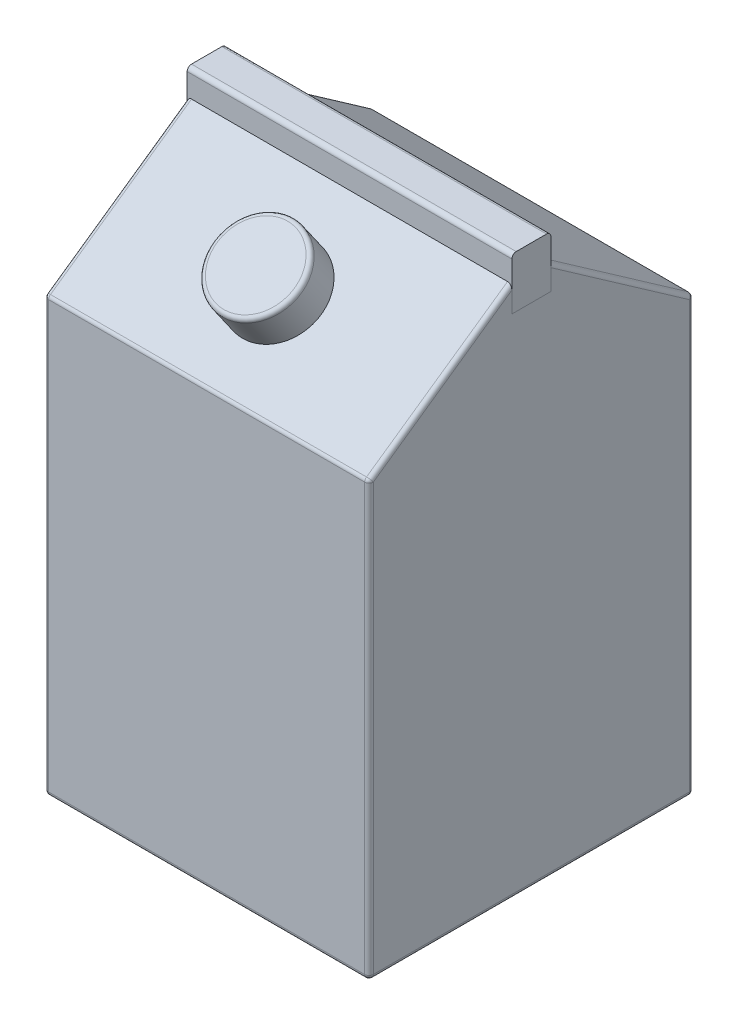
from build123d import *

# Parameters (mm, degrees)
BOSS_EXTRUDE2_DEPTH = 37.5
SKETCH5_W           = 75
SKETCH5_H           = 9
BOSS_EXTRUDE3_DEPTH = 12
SKETCH6_R           = 10
BOSS_EXTRUDE4_DEPTH = 9
FILLET1_R           = 1
FILLET2_R           = 1
FILLET3_R           = 1


with BuildPart() as part:
    # Sketch4 → Boss-Extrude2 (new, symmetric)
    with BuildSketch(Plane(origin=(0, 0, 0), x_dir=(0, 0, -1), z_dir=(1, 0, 0))):
        Polygon((-37.5, 100), (-4.5, 123.106848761), (-4.5, 117.106848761), (4.5, 117.106848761), (4.5, 123.106848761), (37.5, 100), (37.5, 0), (-37.5, 0), align=None)
    extrude(amount=BOSS_EXTRUDE2_DEPTH, both=True)

    # Fillet2
    fillet2_edges = [part.edges().sort_by_distance(p)[0] for p in [
        (-37.5, 111.55342438, -21),
        (-37.5, 50, -37.5),
        (-37.5, 0, 0),
        (-37.5, 50, 37.5),
        (37.5, 50, -37.5),
        (0, 100, 37.5),
        (0, 100, -37.5),
        (0, 0, -37.5),
        (0, 0, 37.5),
        (37.5, 111.55342438, -21),
        (37.5, 111.55342438, 21),
        (37.5, 50, 37.5),
        (-37.5, 111.55342438, 21),
        (37.5, 0, 0),
    ]]
    fillet(fillet2_edges, radius=FILLET2_R)


with BuildPart() as body_2:
    # Sketch5 → Boss-Extrude3 (new body)
    with BuildSketch(Plane(origin=(0, 117.106848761, 0), x_dir=(1, 0, 0), z_dir=(0, 1, 0))):
        Rectangle(SKETCH5_W, SKETCH5_H)
    extrude(amount=BOSS_EXTRUDE3_DEPTH)

    # Fillet3
    fillet3_edges = [body_2.edges().sort_by_distance(p)[0] for p in [
        (0, 129.106848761, 4.5),
        (0, 129.106848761, -4.5),
    ]]
    fillet(fillet3_edges, radius=FILLET3_R)


with BuildPart() as body_3:
    # Sketch6 → Boss-Extrude4 (new body)
    with BuildSketch(Plane(origin=(0, 84.720243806, 59.321753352), x_dir=(1, 0, 0), z_dir=(0, 0.8191520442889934, 0.573576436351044))):
        with Locations(Location((0, 46.782222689, 0), (0, 0, 270))):
            Circle(SKETCH6_R)
    extrude(amount=BOSS_EXTRUDE4_DEPTH)

    # Fillet1
    fillet1_edges = [body_3.edges().sort_by_distance(p)[0] for p in [
        (0, 124.661557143, 17.970667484),
    ]]
    fillet(fillet1_edges, radius=FILLET1_R)


solid = Compound([part.part, body_2.part, body_3.part])
